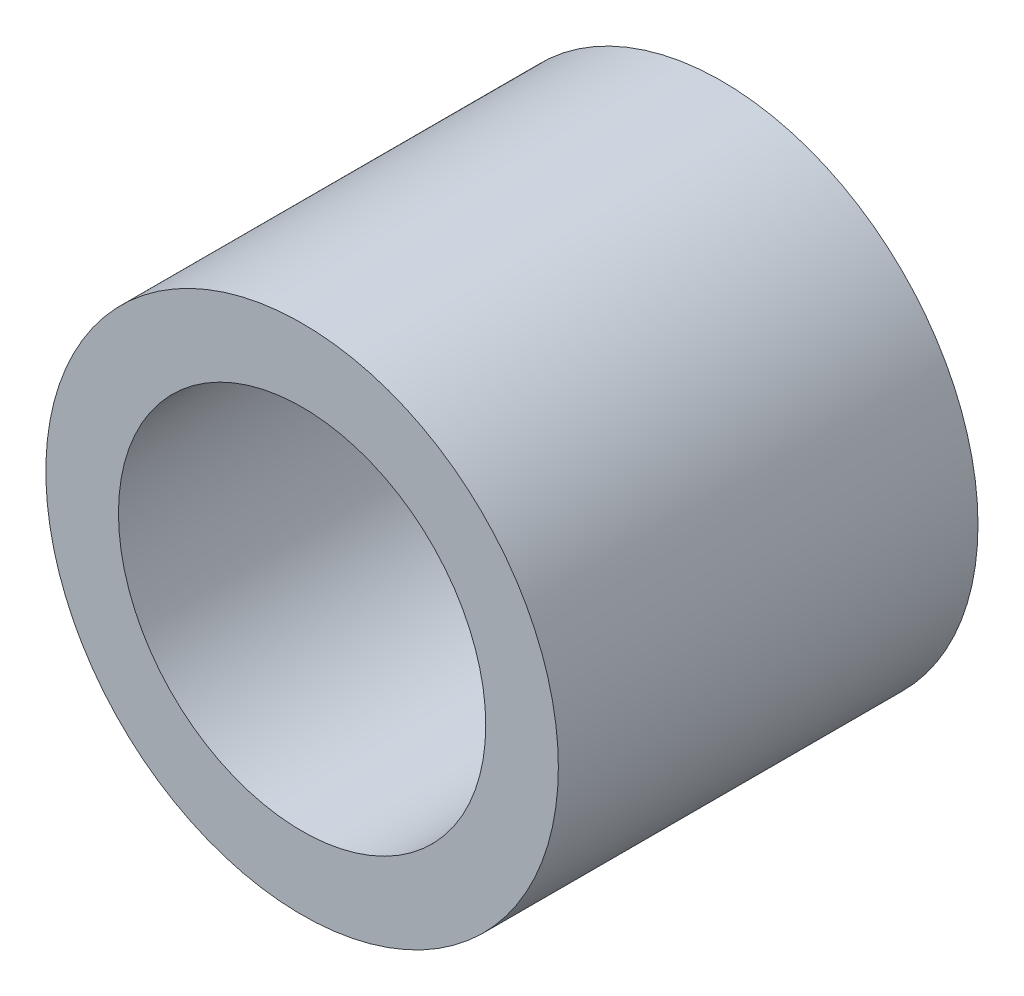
from build123d import *

# Parameters (mm, degrees)
ESQUISSE1_R      = 12
ESQUISSE1_R_2    = 8.6
EXTRUSION1_DEPTH = 19.65


with BuildPart() as part:
    # Esquisse1 → Extrusion1 (new body)
    with BuildSketch(Plane.XY):
        Circle(ESQUISSE1_R)
        Circle(ESQUISSE1_R_2, mode=Mode.SUBTRACT)
    extrude(amount=EXTRUSION1_DEPTH)


solid = part.part
